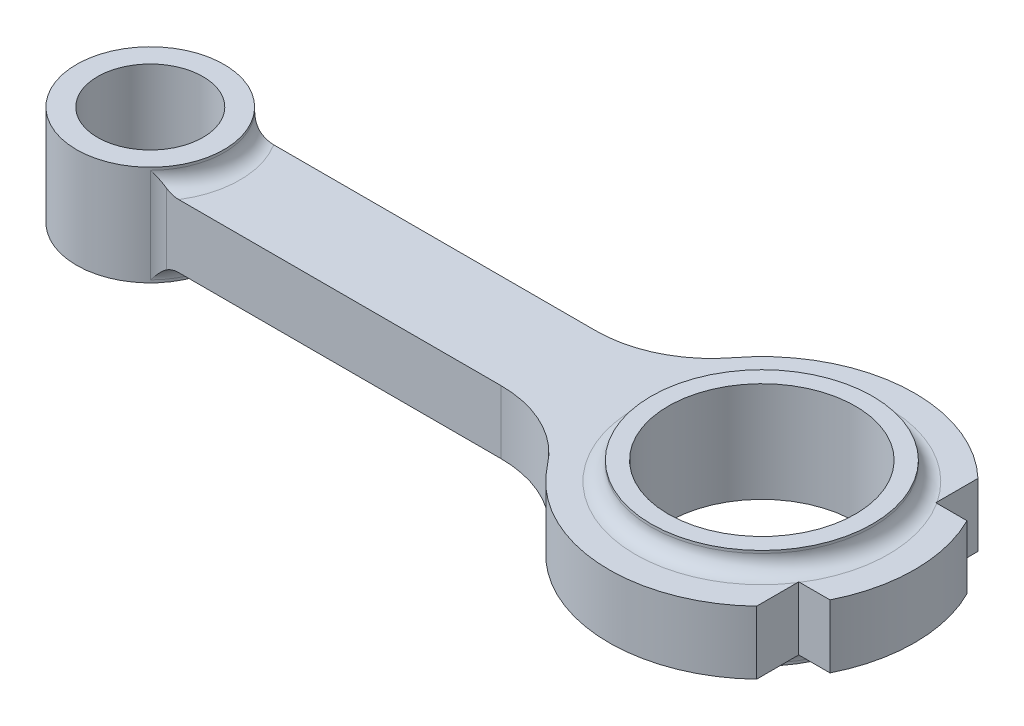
ISO-10303-21;
HEADER;
FILE_DESCRIPTION(('STEP AP214'),'2;1');
FILE_NAME('part.step','',(''),(''),'','','');
FILE_SCHEMA(('AUTOMOTIVE_DESIGN { 1 0 10303 214 1 1 1 1 }'));
ENDSEC;
DATA;
#1=APPLICATION_CONTEXT('core data for automotive mechanical design processes');
#2=APPLICATION_PROTOCOL_DEFINITION('international standard','automotive_design',2000,#1);
#3=PRODUCT_CONTEXT('',#1,'mechanical');
#4=PRODUCT('Part','Part','',(#3));
#5=PRODUCT_RELATED_PRODUCT_CATEGORY('part','',(#4));
#6=PRODUCT_DEFINITION_FORMATION('','',#4);
#7=PRODUCT_DEFINITION_CONTEXT('part definition',#1,'design');
#8=PRODUCT_DEFINITION('design','',#6,#7);
#9=PRODUCT_DEFINITION_SHAPE('','',#8);
#10=(LENGTH_UNIT() NAMED_UNIT(*) SI_UNIT(.MILLI.,.METRE.));
#11=(NAMED_UNIT(*) PLANE_ANGLE_UNIT() SI_UNIT($,.RADIAN.));
#12=(NAMED_UNIT(*) SI_UNIT($,.STERADIAN.) SOLID_ANGLE_UNIT());
#13=UNCERTAINTY_MEASURE_WITH_UNIT(LENGTH_MEASURE(1.E-05),#10,'distance_accuracy_value','');
#14=(GEOMETRIC_REPRESENTATION_CONTEXT(3) GLOBAL_UNCERTAINTY_ASSIGNED_CONTEXT((#13)) GLOBAL_UNIT_ASSIGNED_CONTEXT((#10,
#11,#12)) REPRESENTATION_CONTEXT('',''));
#15=CARTESIAN_POINT('',(0.,0.,0.));
#16=DIRECTION('',(0.,0.,1.));
#17=DIRECTION('',(1.,0.,0.));
#18=AXIS2_PLACEMENT_3D('',#15,#16,#17);
#19=CARTESIAN_POINT('',(0.,-6.,0.));
#20=DIRECTION('',(0.,1.,0.));
#21=DIRECTION('',(0.,0.,1.));
#22=AXIS2_PLACEMENT_3D('',#19,#20,#21);
#23=PLANE('',#22);
#24=DIRECTION('',(1.,0.,0.));
#25=VECTOR('',#24,1.);
#26=CARTESIAN_POINT('',(10.7238052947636,-6.,9.));
#27=LINE('',#26,#25);
#28=CARTESIAN_POINT('',(14.422205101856,-6.,9.));
#29=VERTEX_POINT('',#28);
#30=CARTESIAN_POINT('',(75.5030865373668,-6.,9.));
#31=VERTEX_POINT('',#30);
#32=EDGE_CURVE('E201',#29,#31,#27,.T.);
#33=ORIENTED_EDGE('',*,*,#32,.F.);
#34=CARTESIAN_POINT('',(0.,-6.,0.));
#35=DIRECTION('',(0.,1.,0.));
#36=DIRECTION('',(0.,0.,1.));
#37=AXIS2_PLACEMENT_3D('',#34,#35,#36);
#38=CIRCLE('',#37,17.);
#39=CARTESIAN_POINT('',(14.422205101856,-6.,-9.));
#40=VERTEX_POINT('',#39);
#41=EDGE_CURVE('E309',#29,#40,#38,.T.);
#42=ORIENTED_EDGE('',*,*,#41,.T.);
#43=DIRECTION('',(-1.,0.,0.));
#44=VECTOR('',#43,1.);
#45=CARTESIAN_POINT('',(10.7238052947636,-6.,-9.));
#46=LINE('',#45,#44);
#47=CARTESIAN_POINT('',(75.5030865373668,-6.,-9.));
#48=VERTEX_POINT('',#47);
#49=EDGE_CURVE('E195',#48,#40,#46,.T.);
#50=ORIENTED_EDGE('',*,*,#49,.F.);
#51=CARTESIAN_POINT('',(75.5030865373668,-6.,-31.));
#52=DIRECTION('',(0.,-1.,0.));
#53=DIRECTION('',(0.,0.,1.));
#54=AXIS2_PLACEMENT_3D('',#51,#52,#53);
#55=CIRCLE('',#54,22.);
#56=CARTESIAN_POINT('',(92.9723433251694,-6.,-17.6274509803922));
#57=VERTEX_POINT('',#56);
#58=EDGE_CURVE('E254',#57,#48,#55,.T.);
#59=ORIENTED_EDGE('',*,*,#58,.F.);
#60=CARTESIAN_POINT('',(116.,-6.,0.));
#61=DIRECTION('',(0.,1.,0.));
#62=DIRECTION('',(0.,0.,1.));
#63=AXIS2_PLACEMENT_3D('',#60,#61,#62);
#64=CIRCLE('',#63,29.);
#65=CARTESIAN_POINT('',(136.,-6.,-21.));
#66=VERTEX_POINT('',#65);
#67=EDGE_CURVE('E252',#66,#57,#64,.T.);
#68=ORIENTED_EDGE('',*,*,#67,.F.);
#69=DIRECTION('',(0.,0.,-1.));
#70=VECTOR('',#69,1.);
#71=CARTESIAN_POINT('',(136.,-6.,-21.));
#72=LINE('',#71,#70);
#73=CARTESIAN_POINT('',(136.,-6.,-13.2664991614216));
#74=VERTEX_POINT('',#73);
#75=EDGE_CURVE('E250',#74,#66,#72,.T.);
#76=ORIENTED_EDGE('',*,*,#75,.F.);
#77=CARTESIAN_POINT('',(116.,-6.,0.));
#78=DIRECTION('',(0.,1.,0.));
#79=DIRECTION('',(0.,0.,1.));
#80=AXIS2_PLACEMENT_3D('',#77,#78,#79);
#81=CIRCLE('',#80,24.);
#82=CARTESIAN_POINT('',(136.,-6.,13.2664991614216));
#83=VERTEX_POINT('',#82);
#84=EDGE_CURVE('E306',#74,#83,#81,.T.);
#85=ORIENTED_EDGE('',*,*,#84,.T.);
#86=DIRECTION('',(0.,0.,-1.));
#87=VECTOR('',#86,1.);
#88=CARTESIAN_POINT('',(136.,-6.,21.));
#89=LINE('',#88,#87);
#90=CARTESIAN_POINT('',(136.,-6.,21.));
#91=VERTEX_POINT('',#90);
#92=EDGE_CURVE('E240',#91,#83,#89,.T.);
#93=ORIENTED_EDGE('',*,*,#92,.F.);
#94=CARTESIAN_POINT('',(116.,-6.,0.));
#95=DIRECTION('',(0.,1.,0.));
#96=DIRECTION('',(0.,0.,1.));
#97=AXIS2_PLACEMENT_3D('',#94,#95,#96);
#98=CIRCLE('',#97,29.);
#99=CARTESIAN_POINT('',(92.9723433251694,-6.,17.6274509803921));
#100=VERTEX_POINT('',#99);
#101=EDGE_CURVE('E238',#100,#91,#98,.T.);
#102=ORIENTED_EDGE('',*,*,#101,.F.);
#103=CARTESIAN_POINT('',(75.5030865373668,-6.,31.));
#104=DIRECTION('',(0.,-1.,0.));
#105=DIRECTION('',(0.,0.,-1.));
#106=AXIS2_PLACEMENT_3D('',#103,#104,#105);
#107=CIRCLE('',#106,22.);
#108=EDGE_CURVE('E235',#31,#100,#107,.T.);
#109=ORIENTED_EDGE('',*,*,#108,.F.);
#110=EDGE_LOOP('',(#33,#42,#50,#59,#68,#76,#85,#93,#102,#109));
#111=FACE_BOUND('',#110,.T.);
#112=ADVANCED_FACE('F39',(#111),#23,.F.);
#113=CARTESIAN_POINT('',(0.,6.,0.));
#114=DIRECTION('',(0.,1.,0.));
#115=DIRECTION('',(0.,0.,1.));
#116=AXIS2_PLACEMENT_3D('',#113,#114,#115);
#117=PLANE('',#116);
#118=DIRECTION('',(-1.,0.,0.));
#119=VECTOR('',#118,1.);
#120=CARTESIAN_POINT('',(10.7238052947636,6.,-9.));
#121=LINE('',#120,#119);
#122=CARTESIAN_POINT('',(75.5030865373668,6.,-9.));
#123=VERTEX_POINT('',#122);
#124=CARTESIAN_POINT('',(14.422205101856,6.,-9.));
#125=VERTEX_POINT('',#124);
#126=EDGE_CURVE('E231',#123,#125,#121,.T.);
#127=ORIENTED_EDGE('',*,*,#126,.T.);
#128=CARTESIAN_POINT('',(0.,6.,0.));
#129=DIRECTION('',(0.,1.,0.));
#130=DIRECTION('',(0.,0.,1.));
#131=AXIS2_PLACEMENT_3D('',#128,#129,#130);
#132=CIRCLE('',#131,17.);
#133=CARTESIAN_POINT('',(14.422205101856,6.,9.));
#134=VERTEX_POINT('',#133);
#135=EDGE_CURVE('E191',#125,#134,#132,.F.);
#136=ORIENTED_EDGE('',*,*,#135,.T.);
#137=DIRECTION('',(1.,0.,0.));
#138=VECTOR('',#137,1.);
#139=CARTESIAN_POINT('',(10.7238052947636,6.,9.));
#140=LINE('',#139,#138);
#141=CARTESIAN_POINT('',(75.5030865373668,6.,9.));
#142=VERTEX_POINT('',#141);
#143=EDGE_CURVE('E183',#134,#142,#140,.T.);
#144=ORIENTED_EDGE('',*,*,#143,.T.);
#145=CARTESIAN_POINT('',(75.5030865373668,6.,31.));
#146=DIRECTION('',(0.,-1.,0.));
#147=DIRECTION('',(0.,0.,-1.));
#148=AXIS2_PLACEMENT_3D('',#145,#146,#147);
#149=CIRCLE('',#148,22.);
#150=CARTESIAN_POINT('',(92.9723433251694,6.,17.6274509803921));
#151=VERTEX_POINT('',#150);
#152=EDGE_CURVE('E188',#142,#151,#149,.T.);
#153=ORIENTED_EDGE('',*,*,#152,.T.);
#154=CARTESIAN_POINT('',(116.,6.,0.));
#155=DIRECTION('',(0.,1.,0.));
#156=DIRECTION('',(0.,0.,1.));
#157=AXIS2_PLACEMENT_3D('',#154,#155,#156);
#158=CIRCLE('',#157,29.);
#159=CARTESIAN_POINT('',(136.,6.,21.));
#160=VERTEX_POINT('',#159);
#161=EDGE_CURVE('E210',#151,#160,#158,.T.);
#162=ORIENTED_EDGE('',*,*,#161,.T.);
#163=DIRECTION('',(0.,0.,-1.));
#164=VECTOR('',#163,1.);
#165=CARTESIAN_POINT('',(136.,6.,21.));
#166=LINE('',#165,#164);
#167=CARTESIAN_POINT('',(136.,6.,13.2664991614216));
#168=VERTEX_POINT('',#167);
#169=EDGE_CURVE('E212',#160,#168,#166,.T.);
#170=ORIENTED_EDGE('',*,*,#169,.T.);
#171=CARTESIAN_POINT('',(116.,6.,0.));
#172=DIRECTION('',(0.,1.,0.));
#173=DIRECTION('',(0.,0.,1.));
#174=AXIS2_PLACEMENT_3D('',#171,#172,#173);
#175=CIRCLE('',#174,24.);
#176=CARTESIAN_POINT('',(136.,6.,-13.2664991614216));
#177=VERTEX_POINT('',#176);
#178=EDGE_CURVE('E300',#168,#177,#175,.F.);
#179=ORIENTED_EDGE('',*,*,#178,.T.);
#180=DIRECTION('',(0.,0.,-1.));
#181=VECTOR('',#180,1.);
#182=CARTESIAN_POINT('',(136.,6.,-21.));
#183=LINE('',#182,#181);
#184=CARTESIAN_POINT('',(136.,6.,-21.));
#185=VERTEX_POINT('',#184);
#186=EDGE_CURVE('E225',#177,#185,#183,.T.);
#187=ORIENTED_EDGE('',*,*,#186,.T.);
#188=CARTESIAN_POINT('',(116.,6.,0.));
#189=DIRECTION('',(0.,1.,0.));
#190=DIRECTION('',(0.,0.,1.));
#191=AXIS2_PLACEMENT_3D('',#188,#189,#190);
#192=CIRCLE('',#191,29.);
#193=CARTESIAN_POINT('',(92.9723433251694,6.,-17.6274509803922));
#194=VERTEX_POINT('',#193);
#195=EDGE_CURVE('E227',#185,#194,#192,.T.);
#196=ORIENTED_EDGE('',*,*,#195,.T.);
#197=CARTESIAN_POINT('',(75.5030865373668,6.,-31.));
#198=DIRECTION('',(0.,-1.,0.));
#199=DIRECTION('',(0.,0.,1.));
#200=AXIS2_PLACEMENT_3D('',#197,#198,#199);
#201=CIRCLE('',#200,22.);
#202=EDGE_CURVE('E229',#194,#123,#201,.T.);
#203=ORIENTED_EDGE('',*,*,#202,.T.);
#204=EDGE_LOOP('',(#127,#136,#144,#153,#162,#170,#179,#187,#196,#203));
#205=FACE_BOUND('',#204,.T.);
#206=ADVANCED_FACE('F186',(#205),#117,.T.);
#207=CARTESIAN_POINT('',(0.,6.,0.));
#208=DIRECTION('',(0.,-1.,0.));
#209=DIRECTION('',(0.,0.,-1.));
#210=AXIS2_PLACEMENT_3D('',#207,#208,#209);
#211=CYLINDRICAL_SURFACE('',#210,14.);
#212=DIRECTION('',(0.,-1.,0.));
#213=VECTOR('',#212,1.);
#214=CARTESIAN_POINT('',(9.91660730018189,6.,9.88235294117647));
#215=LINE('',#214,#213);
#216=CARTESIAN_POINT('',(9.91660730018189,-9.,9.88235294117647));
#217=VERTEX_POINT('',#216);
#218=CARTESIAN_POINT('',(9.91660730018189,9.,9.88235294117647));
#219=VERTEX_POINT('',#218);
#220=EDGE_CURVE('E287',#217,#219,#215,.F.);
#221=ORIENTED_EDGE('',*,*,#220,.T.);
#222=CARTESIAN_POINT('',(0.,9.,0.));
#223=DIRECTION('',(0.,1.,0.));
#224=DIRECTION('',(0.,0.,1.));
#225=AXIS2_PLACEMENT_3D('',#222,#223,#224);
#226=CIRCLE('',#225,14.);
#227=CARTESIAN_POINT('',(9.91660730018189,9.,-9.88235294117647));
#228=VERTEX_POINT('',#227);
#229=EDGE_CURVE('E292',#219,#228,#226,.T.);
#230=ORIENTED_EDGE('',*,*,#229,.T.);
#231=DIRECTION('',(0.,-1.,0.));
#232=VECTOR('',#231,1.);
#233=CARTESIAN_POINT('',(9.91660730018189,6.,-9.88235294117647));
#234=LINE('',#233,#232);
#235=CARTESIAN_POINT('',(9.91660730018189,-9.,-9.88235294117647));
#236=VERTEX_POINT('',#235);
#237=EDGE_CURVE('E289',#228,#236,#234,.T.);
#238=ORIENTED_EDGE('',*,*,#237,.T.);
#239=CARTESIAN_POINT('',(0.,-9.,0.));
#240=DIRECTION('',(0.,1.,0.));
#241=DIRECTION('',(0.,0.,1.));
#242=AXIS2_PLACEMENT_3D('',#239,#240,#241);
#243=CIRCLE('',#242,14.);
#244=EDGE_CURVE('E204',#236,#217,#243,.F.);
#245=ORIENTED_EDGE('',*,*,#244,.T.);
#246=EDGE_LOOP('',(#221,#230,#238,#245));
#247=FACE_BOUND('',#246,.T.);
#248=CARTESIAN_POINT('',(0.,-9.5,0.));
#249=DIRECTION('',(0.,1.,0.));
#250=DIRECTION('',(0.,0.,1.));
#251=AXIS2_PLACEMENT_3D('',#248,#249,#250);
#252=CIRCLE('',#251,14.);
#253=CARTESIAN_POINT('',(0.,-9.5,14.));
#254=VERTEX_POINT('',#253);
#255=EDGE_CURVE('E538',#254,#254,#252,.T.);
#256=ORIENTED_EDGE('',*,*,#255,.T.);
#257=EDGE_LOOP('',(#256));
#258=FACE_BOUND('',#257,.T.);
#259=CARTESIAN_POINT('',(0.,9.5,0.));
#260=DIRECTION('',(0.,1.,0.));
#261=DIRECTION('',(0.,0.,1.));
#262=AXIS2_PLACEMENT_3D('',#259,#260,#261);
#263=CIRCLE('',#262,14.);
#264=CARTESIAN_POINT('',(0.,9.5,14.));
#265=VERTEX_POINT('',#264);
#266=EDGE_CURVE('E236',#265,#265,#263,.T.);
#267=ORIENTED_EDGE('',*,*,#266,.F.);
#268=EDGE_LOOP('',(#267));
#269=FACE_BOUND('',#268,.T.);
#270=ADVANCED_FACE('F370',(#247,#258,#269),#211,.T.);
#271=CARTESIAN_POINT('',(10.7238052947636,6.,9.));
#272=DIRECTION('',(0.,0.,-1.));
#273=DIRECTION('',(-1.,0.,0.));
#274=AXIS2_PLACEMENT_3D('',#271,#272,#273);
#275=PLANE('',#274);
#276=ORIENTED_EDGE('',*,*,#143,.F.);
#277=CARTESIAN_POINT('',(14.422205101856,6.,9.));
#278=CARTESIAN_POINT('',(14.2926652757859,6.00001803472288,9.));
#279=CARTESIAN_POINT('',(14.1632279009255,6.00604067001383,9.));
#280=CARTESIAN_POINT('',(13.9054130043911,6.02988516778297,9.));
#281=CARTESIAN_POINT('',(13.7770357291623,6.04770969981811,9.));
#282=CARTESIAN_POINT('',(13.4019529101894,6.11725277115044,9.));
#283=CARTESIAN_POINT('',(13.1579920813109,6.18508325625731,9.));
#284=CARTESIAN_POINT('',(12.7681333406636,6.33205951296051,9.));
#285=CARTESIAN_POINT('',(12.6175516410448,6.39913693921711,9.));
#286=CARTESIAN_POINT('',(12.3973138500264,6.51373319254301,9.));
#287=CARTESIAN_POINT('',(12.3242209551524,6.55468746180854,9.));
#288=CARTESIAN_POINT('',(12.1807619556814,6.64119544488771,9.));
#289=CARTESIAN_POINT('',(12.1103972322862,6.68675144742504,9.));
#290=CARTESIAN_POINT('',(12.0415945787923,6.73459123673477,9.));
#291=B_SPLINE_CURVE_WITH_KNOTS('',3,(#277,#278,#279,#280,#281,#282,#283,#284,#285,#286,#287,
#288,#289,#290),.UNSPECIFIED.,.F.,.F.,(4,2,2,2,2,2,4),(0.,0.388285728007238,0.776659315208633,
1.53179836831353,2.02523360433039,2.27642690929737,2.52774576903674),.UNSPECIFIED.);
#292=CARTESIAN_POINT('',(12.0415945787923,6.73459123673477,9.));
#293=VERTEX_POINT('',#292);
#294=EDGE_CURVE('E317',#134,#293,#291,.T.);
#295=ORIENTED_EDGE('',*,*,#294,.T.);
#296=DIRECTION('',(0.,1.,0.));
#297=VECTOR('',#296,1.);
#298=CARTESIAN_POINT('',(12.0415945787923,-6.,9.));
#299=LINE('',#298,#297);
#300=CARTESIAN_POINT('',(12.0415945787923,-6.73459123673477,9.));
#301=VERTEX_POINT('',#300);
#302=EDGE_CURVE('E296',#293,#301,#299,.F.);
#303=ORIENTED_EDGE('',*,*,#302,.T.);
#304=CARTESIAN_POINT('',(12.0415945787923,-6.73459123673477,9.));
#305=CARTESIAN_POINT('',(12.1482045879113,-6.66048426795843,9.));
#306=CARTESIAN_POINT('',(12.2585398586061,-6.59184174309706,9.));
#307=CARTESIAN_POINT('',(12.4853214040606,-6.46561457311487,9.));
#308=CARTESIAN_POINT('',(12.6017654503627,-6.40802593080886,9.));
#309=CARTESIAN_POINT('',(12.8363697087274,-6.30535343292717,9.));
#310=CARTESIAN_POINT('',(12.9544037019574,-6.25997988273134,9.));
#311=CARTESIAN_POINT('',(13.1940085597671,-6.17993199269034,9.));
#312=CARTESIAN_POINT('',(13.3155787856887,-6.14525573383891,9.));
#313=CARTESIAN_POINT('',(13.5980055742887,-6.0780318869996,9.));
#314=CARTESIAN_POINT('',(13.7597620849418,-6.0492059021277,9.));
#315=CARTESIAN_POINT('',(14.0883841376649,-6.01002616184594,9.));
#316=CARTESIAN_POINT('',(14.2552894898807,-6.00000655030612,9.));
#317=CARTESIAN_POINT('',(14.422205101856,-6.,9.));
#318=B_SPLINE_CURVE_WITH_KNOTS('',3,(#304,#305,#306,#307,#308,#309,#310,#311,#312,#313,#314,
#315,#316,#317),.UNSPECIFIED.,.F.,.F.,(4,2,2,2,2,2,4),(0.,0.389255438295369,0.778369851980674,
1.15722376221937,1.53600966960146,2.02780445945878,2.52825744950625),.UNSPECIFIED.);
#319=EDGE_CURVE('E515',#301,#29,#318,.T.);
#320=ORIENTED_EDGE('',*,*,#319,.T.);
#321=ORIENTED_EDGE('',*,*,#32,.T.);
#322=DIRECTION('',(0.,-1.,0.));
#323=VECTOR('',#322,1.);
#324=CARTESIAN_POINT('',(75.5030865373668,6.,9.));
#325=LINE('',#324,#323);
#326=EDGE_CURVE('E198',#142,#31,#325,.T.);
#327=ORIENTED_EDGE('',*,*,#326,.F.);
#328=EDGE_LOOP('',(#276,#295,#303,#320,#321,#327));
#329=FACE_BOUND('',#328,.T.);
#330=ADVANCED_FACE('F199',(#329),#275,.F.);
#331=CARTESIAN_POINT('',(75.5030865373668,6.,31.));
#332=DIRECTION('',(0.,-1.,0.));
#333=DIRECTION('',(0.,0.,-1.));
#334=AXIS2_PLACEMENT_3D('',#331,#332,#333);
#335=CYLINDRICAL_SURFACE('',#334,22.);
#336=ORIENTED_EDGE('',*,*,#108,.T.);
#337=DIRECTION('',(0.,-1.,0.));
#338=VECTOR('',#337,1.);
#339=CARTESIAN_POINT('',(92.9723433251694,6.,17.6274509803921));
#340=LINE('',#339,#338);
#341=EDGE_CURVE('E205',#151,#100,#340,.T.);
#342=ORIENTED_EDGE('',*,*,#341,.F.);
#343=ORIENTED_EDGE('',*,*,#152,.F.);
#344=ORIENTED_EDGE('',*,*,#326,.T.);
#345=EDGE_LOOP('',(#336,#342,#343,#344));
#346=FACE_BOUND('',#345,.T.);
#347=ADVANCED_FACE('F207',(#346),#335,.F.);
#348=CARTESIAN_POINT('',(116.,6.,0.));
#349=DIRECTION('',(0.,-1.,0.));
#350=DIRECTION('',(0.,0.,-1.));
#351=AXIS2_PLACEMENT_3D('',#348,#349,#350);
#352=CYLINDRICAL_SURFACE('',#351,29.);
#353=ORIENTED_EDGE('',*,*,#101,.T.);
#354=DIRECTION('',(0.,-1.,0.));
#355=VECTOR('',#354,1.);
#356=CARTESIAN_POINT('',(136.,6.,21.));
#357=LINE('',#356,#355);
#358=EDGE_CURVE('E274',#160,#91,#357,.T.);
#359=ORIENTED_EDGE('',*,*,#358,.F.);
#360=ORIENTED_EDGE('',*,*,#161,.F.);
#361=ORIENTED_EDGE('',*,*,#341,.T.);
#362=EDGE_LOOP('',(#353,#359,#360,#361));
#363=FACE_BOUND('',#362,.T.);
#364=ADVANCED_FACE('F462',(#363),#352,.T.);
#365=CARTESIAN_POINT('',(136.,6.,21.));
#366=DIRECTION('',(-1.,0.,0.));
#367=DIRECTION('',(0.,0.,1.));
#368=AXIS2_PLACEMENT_3D('',#365,#366,#367);
#369=PLANE('',#368);
#370=ORIENTED_EDGE('',*,*,#92,.T.);
#371=CARTESIAN_POINT('',(136.,-6.,13.2664991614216));
#372=CARTESIAN_POINT('',(136.,-6.0000040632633,13.2220747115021));
#373=CARTESIAN_POINT('',(136.,-6.00030346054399,13.1776542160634));
#374=CARTESIAN_POINT('',(136.,-6.00149292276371,13.0888211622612));
#375=CARTESIAN_POINT('',(136.,-6.00238298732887,13.0444086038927));
#376=CARTESIAN_POINT('',(136.,-6.00356838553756,13.));
#377=B_SPLINE_CURVE_WITH_KNOTS('',3,(#371,#372,#373,#374,#375,#376),.UNSPECIFIED.,.F.,.F.,(4,2,
4),(0.,0.13326451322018,0.266528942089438),.UNSPECIFIED.);
#378=CARTESIAN_POINT('',(136.,-6.00356838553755,13.));
#379=VERTEX_POINT('',#378);
#380=EDGE_CURVE('E419',#83,#379,#377,.T.);
#381=ORIENTED_EDGE('',*,*,#380,.T.);
#382=DIRECTION('',(0.,-1.,0.));
#383=VECTOR('',#382,1.);
#384=CARTESIAN_POINT('',(136.,6.,13.));
#385=LINE('',#384,#383);
#386=CARTESIAN_POINT('',(136.,6.00356838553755,13.));
#387=VERTEX_POINT('',#386);
#388=EDGE_CURVE('E62',#387,#379,#385,.T.);
#389=ORIENTED_EDGE('',*,*,#388,.F.);
#390=CARTESIAN_POINT('',(136.,6.00356838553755,13.));
#391=CARTESIAN_POINT('',(136.,6.00238298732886,13.0444086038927));
#392=CARTESIAN_POINT('',(136.,6.00149292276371,13.0888211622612));
#393=CARTESIAN_POINT('',(136.,6.00030346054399,13.1776542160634));
#394=CARTESIAN_POINT('',(136.,6.0000040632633,13.2220747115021));
#395=CARTESIAN_POINT('',(136.,6.,13.2664991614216));
#396=B_SPLINE_CURVE_WITH_KNOTS('',3,(#390,#391,#392,#393,#394,#395),.UNSPECIFIED.,.F.,.F.,(4,2,
4),(0.,0.133264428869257,0.266528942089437),.UNSPECIFIED.);
#397=EDGE_CURVE('E11',#387,#168,#396,.T.);
#398=ORIENTED_EDGE('',*,*,#397,.T.);
#399=ORIENTED_EDGE('',*,*,#169,.F.);
#400=ORIENTED_EDGE('',*,*,#358,.T.);
#401=EDGE_LOOP('',(#370,#381,#389,#398,#399,#400));
#402=FACE_BOUND('',#401,.T.);
#403=ADVANCED_FACE('F457',(#402),#369,.F.);
#404=CARTESIAN_POINT('',(136.,6.,13.));
#405=DIRECTION('',(0.,0.,-1.));
#406=DIRECTION('',(-1.,0.,0.));
#407=AXIS2_PLACEMENT_3D('',#404,#405,#406);
#408=PLANE('',#407);
#409=ORIENTED_EDGE('',*,*,#388,.T.);
#410=CARTESIAN_POINT('',(136.,-6.00356838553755,13.));
#411=CARTESIAN_POINT('',(136.029027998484,-6.00237966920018,13.));
#412=CARTESIAN_POINT('',(136.058062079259,-6.00148794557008,13.));
#413=CARTESIAN_POINT('',(136.1161424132,-6.00029848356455,13.));
#414=CARTESIAN_POINT('',(136.145188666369,-6.0000007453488,13.));
#415=CARTESIAN_POINT('',(136.174241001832,-6.,13.));
#416=B_SPLINE_CURVE_WITH_KNOTS('',3,(#410,#411,#412,#413,#414,#415),.UNSPECIFIED.,.F.,.F.,(4,2,
4),(0.,0.0871433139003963,0.174286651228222),.UNSPECIFIED.);
#417=CARTESIAN_POINT('',(136.174241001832,-6.,13.));
#418=VERTEX_POINT('',#417);
#419=EDGE_CURVE('E411',#379,#418,#416,.T.);
#420=ORIENTED_EDGE('',*,*,#419,.T.);
#421=DIRECTION('',(1.,0.,0.));
#422=VECTOR('',#421,1.);
#423=CARTESIAN_POINT('',(136.,-6.,13.));
#424=LINE('',#423,#422);
#425=CARTESIAN_POINT('',(141.922962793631,-6.,13.));
#426=VERTEX_POINT('',#425);
#427=EDGE_CURVE('E243',#418,#426,#424,.T.);
#428=ORIENTED_EDGE('',*,*,#427,.T.);
#429=DIRECTION('',(0.,-1.,0.));
#430=VECTOR('',#429,1.);
#431=CARTESIAN_POINT('',(141.922962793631,6.,13.));
#432=LINE('',#431,#430);
#433=CARTESIAN_POINT('',(141.922962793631,6.,13.));
#434=VERTEX_POINT('',#433);
#435=EDGE_CURVE('E270',#434,#426,#432,.T.);
#436=ORIENTED_EDGE('',*,*,#435,.F.);
#437=DIRECTION('',(1.,0.,0.));
#438=VECTOR('',#437,1.);
#439=CARTESIAN_POINT('',(136.,6.,13.));
#440=LINE('',#439,#438);
#441=CARTESIAN_POINT('',(136.174241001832,6.,13.));
#442=VERTEX_POINT('',#441);
#443=EDGE_CURVE('E218',#442,#434,#440,.T.);
#444=ORIENTED_EDGE('',*,*,#443,.F.);
#445=CARTESIAN_POINT('',(136.174241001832,6.,13.));
#446=CARTESIAN_POINT('',(136.145188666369,6.00000074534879,13.));
#447=CARTESIAN_POINT('',(136.1161424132,6.00029848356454,13.));
#448=CARTESIAN_POINT('',(136.058062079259,6.00148794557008,13.));
#449=CARTESIAN_POINT('',(136.029027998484,6.00237966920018,13.));
#450=CARTESIAN_POINT('',(136.,6.00356838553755,13.));
#451=B_SPLINE_CURVE_WITH_KNOTS('',3,(#445,#446,#447,#448,#449,#450),.UNSPECIFIED.,.F.,.F.,(4,2,
4),(0.,0.087143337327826,0.174286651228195),.UNSPECIFIED.);
#452=EDGE_CURVE('E55',#442,#387,#451,.T.);
#453=ORIENTED_EDGE('',*,*,#452,.T.);
#454=EDGE_LOOP('',(#409,#420,#428,#436,#444,#453));
#455=FACE_BOUND('',#454,.T.);
#456=ADVANCED_FACE('F461',(#455),#408,.F.);
#457=CARTESIAN_POINT('',(116.,6.,0.));
#458=DIRECTION('',(0.,-1.,0.));
#459=DIRECTION('',(0.,0.,-1.));
#460=AXIS2_PLACEMENT_3D('',#457,#458,#459);
#461=CYLINDRICAL_SURFACE('',#460,29.);
#462=CARTESIAN_POINT('',(116.,-6.,0.));
#463=DIRECTION('',(0.,1.,0.));
#464=DIRECTION('',(0.,0.,1.));
#465=AXIS2_PLACEMENT_3D('',#462,#463,#464);
#466=CIRCLE('',#465,29.);
#467=CARTESIAN_POINT('',(141.922962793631,-6.,-13.));
#468=VERTEX_POINT('',#467);
#469=EDGE_CURVE('E245',#426,#468,#466,.T.);
#470=ORIENTED_EDGE('',*,*,#469,.T.);
#471=DIRECTION('',(0.,-1.,0.));
#472=VECTOR('',#471,1.);
#473=CARTESIAN_POINT('',(141.922962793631,6.,-13.));
#474=LINE('',#473,#472);
#475=CARTESIAN_POINT('',(141.922962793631,6.,-13.));
#476=VERTEX_POINT('',#475);
#477=EDGE_CURVE('E267',#476,#468,#474,.T.);
#478=ORIENTED_EDGE('',*,*,#477,.F.);
#479=CARTESIAN_POINT('',(116.,6.,0.));
#480=DIRECTION('',(0.,1.,0.));
#481=DIRECTION('',(0.,0.,1.));
#482=AXIS2_PLACEMENT_3D('',#479,#480,#481);
#483=CIRCLE('',#482,29.);
#484=EDGE_CURVE('E220',#434,#476,#483,.T.);
#485=ORIENTED_EDGE('',*,*,#484,.F.);
#486=ORIENTED_EDGE('',*,*,#435,.T.);
#487=EDGE_LOOP('',(#470,#478,#485,#486));
#488=FACE_BOUND('',#487,.T.);
#489=ADVANCED_FACE('F693',(#488),#461,.T.);
#490=CARTESIAN_POINT('',(136.,6.,-13.));
#491=DIRECTION('',(0.,0.,1.));
#492=DIRECTION('',(1.,0.,0.));
#493=AXIS2_PLACEMENT_3D('',#490,#491,#492);
#494=PLANE('',#493);
#495=DIRECTION('',(-1.,0.,0.));
#496=VECTOR('',#495,1.);
#497=CARTESIAN_POINT('',(136.,-6.,-13.));
#498=LINE('',#497,#496);
#499=CARTESIAN_POINT('',(136.174241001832,-6.,-13.));
#500=VERTEX_POINT('',#499);
#501=EDGE_CURVE('E247',#468,#500,#498,.T.);
#502=ORIENTED_EDGE('',*,*,#501,.T.);
#503=CARTESIAN_POINT('',(136.174241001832,-6.,-13.));
#504=CARTESIAN_POINT('',(136.145188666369,-6.00000074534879,-13.));
#505=CARTESIAN_POINT('',(136.1161424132,-6.00029848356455,-13.));
#506=CARTESIAN_POINT('',(136.058062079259,-6.00148794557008,-13.));
#507=CARTESIAN_POINT('',(136.029027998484,-6.00237966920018,-13.));
#508=CARTESIAN_POINT('',(136.,-6.00356838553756,-13.));
#509=B_SPLINE_CURVE_WITH_KNOTS('',3,(#503,#504,#505,#506,#507,#508),.UNSPECIFIED.,.F.,.F.,(4,2,
4),(0.,0.087143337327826,0.174286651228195),.UNSPECIFIED.);
#510=CARTESIAN_POINT('',(136.,-6.00356838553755,-13.));
#511=VERTEX_POINT('',#510);
#512=EDGE_CURVE('E413',#500,#511,#509,.T.);
#513=ORIENTED_EDGE('',*,*,#512,.T.);
#514=DIRECTION('',(0.,-1.,0.));
#515=VECTOR('',#514,1.);
#516=CARTESIAN_POINT('',(136.,6.,-13.));
#517=LINE('',#516,#515);
#518=CARTESIAN_POINT('',(136.,6.00356838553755,-13.));
#519=VERTEX_POINT('',#518);
#520=EDGE_CURVE('E70',#519,#511,#517,.T.);
#521=ORIENTED_EDGE('',*,*,#520,.F.);
#522=CARTESIAN_POINT('',(136.,6.00356838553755,-13.));
#523=CARTESIAN_POINT('',(136.029027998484,6.00237966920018,-13.));
#524=CARTESIAN_POINT('',(136.058062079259,6.00148794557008,-13.));
#525=CARTESIAN_POINT('',(136.1161424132,6.00029848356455,-13.));
#526=CARTESIAN_POINT('',(136.145188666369,6.00000074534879,-13.));
#527=CARTESIAN_POINT('',(136.174241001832,6.,-13.));
#528=B_SPLINE_CURVE_WITH_KNOTS('',3,(#522,#523,#524,#525,#526,#527),.UNSPECIFIED.,.F.,.F.,(4,2,
4),(0.,0.0871433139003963,0.174286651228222),.UNSPECIFIED.);
#529=CARTESIAN_POINT('',(136.174241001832,6.,-13.));
#530=VERTEX_POINT('',#529);
#531=EDGE_CURVE('E475',#519,#530,#528,.T.);
#532=ORIENTED_EDGE('',*,*,#531,.T.);
#533=DIRECTION('',(-1.,0.,0.));
#534=VECTOR('',#533,1.);
#535=CARTESIAN_POINT('',(136.,6.,-13.));
#536=LINE('',#535,#534);
#537=EDGE_CURVE('E222',#476,#530,#536,.T.);
#538=ORIENTED_EDGE('',*,*,#537,.F.);
#539=ORIENTED_EDGE('',*,*,#477,.T.);
#540=EDGE_LOOP('',(#502,#513,#521,#532,#538,#539));
#541=FACE_BOUND('',#540,.T.);
#542=ADVANCED_FACE('F438',(#541),#494,.F.);
#543=CARTESIAN_POINT('',(136.,6.,-21.));
#544=DIRECTION('',(-1.,0.,0.));
#545=DIRECTION('',(0.,0.,1.));
#546=AXIS2_PLACEMENT_3D('',#543,#544,#545);
#547=PLANE('',#546);
#548=ORIENTED_EDGE('',*,*,#520,.T.);
#549=CARTESIAN_POINT('',(136.,-6.00356838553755,-13.));
#550=CARTESIAN_POINT('',(136.,-6.00238298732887,-13.0444086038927));
#551=CARTESIAN_POINT('',(136.,-6.00149292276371,-13.0888211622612));
#552=CARTESIAN_POINT('',(136.,-6.00030346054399,-13.1776542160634));
#553=CARTESIAN_POINT('',(136.,-6.0000040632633,-13.2220747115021));
#554=CARTESIAN_POINT('',(136.,-6.,-13.2664991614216));
#555=B_SPLINE_CURVE_WITH_KNOTS('',3,(#549,#550,#551,#552,#553,#554),.UNSPECIFIED.,.F.,.F.,(4,2,
4),(0.,0.133264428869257,0.266528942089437),.UNSPECIFIED.);
#556=EDGE_CURVE('E415',#511,#74,#555,.T.);
#557=ORIENTED_EDGE('',*,*,#556,.T.);
#558=ORIENTED_EDGE('',*,*,#75,.T.);
#559=DIRECTION('',(0.,-1.,0.));
#560=VECTOR('',#559,1.);
#561=CARTESIAN_POINT('',(136.,6.,-21.));
#562=LINE('',#561,#560);
#563=EDGE_CURVE('E263',#185,#66,#562,.T.);
#564=ORIENTED_EDGE('',*,*,#563,.F.);
#565=ORIENTED_EDGE('',*,*,#186,.F.);
#566=CARTESIAN_POINT('',(136.,6.,-13.2664991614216));
#567=CARTESIAN_POINT('',(136.,6.0000040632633,-13.2220747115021));
#568=CARTESIAN_POINT('',(136.,6.00030346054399,-13.1776542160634));
#569=CARTESIAN_POINT('',(136.,6.00149292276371,-13.0888211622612));
#570=CARTESIAN_POINT('',(136.,6.00238298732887,-13.0444086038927));
#571=CARTESIAN_POINT('',(136.,6.00356838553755,-13.));
#572=B_SPLINE_CURVE_WITH_KNOTS('',3,(#566,#567,#568,#569,#570,#571),.UNSPECIFIED.,.F.,.F.,(4,2,
4),(0.,0.13326451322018,0.266528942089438),.UNSPECIFIED.);
#573=EDGE_CURVE('E417',#177,#519,#572,.T.);
#574=ORIENTED_EDGE('',*,*,#573,.T.);
#575=EDGE_LOOP('',(#548,#557,#558,#564,#565,#574));
#576=FACE_BOUND('',#575,.T.);
#577=ADVANCED_FACE('F484',(#576),#547,.F.);
#578=CARTESIAN_POINT('',(116.,6.,0.));
#579=DIRECTION('',(0.,-1.,0.));
#580=DIRECTION('',(0.,0.,-1.));
#581=AXIS2_PLACEMENT_3D('',#578,#579,#580);
#582=CYLINDRICAL_SURFACE('',#581,29.);
#583=ORIENTED_EDGE('',*,*,#67,.T.);
#584=DIRECTION('',(0.,-1.,0.));
#585=VECTOR('',#584,1.);
#586=CARTESIAN_POINT('',(92.9723433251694,6.,-17.6274509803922));
#587=LINE('',#586,#585);
#588=EDGE_CURVE('E260',#194,#57,#587,.T.);
#589=ORIENTED_EDGE('',*,*,#588,.F.);
#590=ORIENTED_EDGE('',*,*,#195,.F.);
#591=ORIENTED_EDGE('',*,*,#563,.T.);
#592=EDGE_LOOP('',(#583,#589,#590,#591));
#593=FACE_BOUND('',#592,.T.);
#594=ADVANCED_FACE('F488',(#593),#582,.T.);
#595=CARTESIAN_POINT('',(75.5030865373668,6.,-31.));
#596=DIRECTION('',(0.,-1.,0.));
#597=DIRECTION('',(0.,0.,-1.));
#598=AXIS2_PLACEMENT_3D('',#595,#596,#597);
#599=CYLINDRICAL_SURFACE('',#598,22.);
#600=ORIENTED_EDGE('',*,*,#58,.T.);
#601=DIRECTION('',(0.,-1.,0.));
#602=VECTOR('',#601,1.);
#603=CARTESIAN_POINT('',(75.5030865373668,6.,-9.));
#604=LINE('',#603,#602);
#605=EDGE_CURVE('E233',#123,#48,#604,.T.);
#606=ORIENTED_EDGE('',*,*,#605,.F.);
#607=ORIENTED_EDGE('',*,*,#202,.F.);
#608=ORIENTED_EDGE('',*,*,#588,.T.);
#609=EDGE_LOOP('',(#600,#606,#607,#608));
#610=FACE_BOUND('',#609,.T.);
#611=ADVANCED_FACE('F493',(#610),#599,.F.);
#612=CARTESIAN_POINT('',(10.7238052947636,6.,-9.));
#613=DIRECTION('',(0.,0.,1.));
#614=DIRECTION('',(1.,0.,0.));
#615=AXIS2_PLACEMENT_3D('',#612,#613,#614);
#616=PLANE('',#615);
#617=ORIENTED_EDGE('',*,*,#49,.T.);
#618=CARTESIAN_POINT('',(14.422205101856,-6.,-9.));
#619=CARTESIAN_POINT('',(14.2926652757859,-6.00001803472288,-9.));
#620=CARTESIAN_POINT('',(14.1632279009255,-6.00604067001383,-9.));
#621=CARTESIAN_POINT('',(13.9054130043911,-6.02988516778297,-9.));
#622=CARTESIAN_POINT('',(13.7770357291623,-6.04770969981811,-9.));
#623=CARTESIAN_POINT('',(13.4019529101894,-6.11725277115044,-9.));
#624=CARTESIAN_POINT('',(13.1579920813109,-6.18508325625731,-9.));
#625=CARTESIAN_POINT('',(12.7681333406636,-6.33205951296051,-9.));
#626=CARTESIAN_POINT('',(12.6175516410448,-6.39913693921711,-9.));
#627=CARTESIAN_POINT('',(12.3973138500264,-6.51373319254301,-9.));
#628=CARTESIAN_POINT('',(12.3242209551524,-6.55468746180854,-9.));
#629=CARTESIAN_POINT('',(12.1807619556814,-6.64119544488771,-9.));
#630=CARTESIAN_POINT('',(12.1103972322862,-6.68675144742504,-9.));
#631=CARTESIAN_POINT('',(12.0415945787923,-6.73459123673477,-9.));
#632=B_SPLINE_CURVE_WITH_KNOTS('',3,(#618,#619,#620,#621,#622,#623,#624,#625,#626,#627,#628,
#629,#630,#631),.UNSPECIFIED.,.F.,.F.,(4,2,2,2,2,2,4),(0.,0.388285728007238,0.776659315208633,
1.53179836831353,2.02523360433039,2.27642690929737,2.52774576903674),.UNSPECIFIED.);
#633=CARTESIAN_POINT('',(12.0415945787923,-6.73459123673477,-9.));
#634=VERTEX_POINT('',#633);
#635=EDGE_CURVE('E452',#40,#634,#632,.T.);
#636=ORIENTED_EDGE('',*,*,#635,.T.);
#637=DIRECTION('',(0.,1.,0.));
#638=VECTOR('',#637,1.);
#639=CARTESIAN_POINT('',(12.0415945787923,6.,-9.));
#640=LINE('',#639,#638);
#641=CARTESIAN_POINT('',(12.0415945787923,6.73459123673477,-9.));
#642=VERTEX_POINT('',#641);
#643=EDGE_CURVE('E294',#634,#642,#640,.T.);
#644=ORIENTED_EDGE('',*,*,#643,.T.);
#645=CARTESIAN_POINT('',(12.0415945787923,6.73459123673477,-9.));
#646=CARTESIAN_POINT('',(12.1482045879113,6.66048426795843,-9.));
#647=CARTESIAN_POINT('',(12.2585398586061,6.59184174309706,-9.));
#648=CARTESIAN_POINT('',(12.4853214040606,6.46561457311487,-9.));
#649=CARTESIAN_POINT('',(12.6017654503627,6.40802593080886,-9.));
#650=CARTESIAN_POINT('',(12.8363697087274,6.30535343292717,-9.));
#651=CARTESIAN_POINT('',(12.9544037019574,6.25997988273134,-9.));
#652=CARTESIAN_POINT('',(13.1940085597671,6.17993199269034,-9.));
#653=CARTESIAN_POINT('',(13.3155787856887,6.14525573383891,-9.));
#654=CARTESIAN_POINT('',(13.5980055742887,6.0780318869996,-9.));
#655=CARTESIAN_POINT('',(13.7597620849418,6.0492059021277,-9.));
#656=CARTESIAN_POINT('',(14.0883841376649,6.01002616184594,-9.));
#657=CARTESIAN_POINT('',(14.2552894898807,6.00000655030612,-9.));
#658=CARTESIAN_POINT('',(14.422205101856,6.,-9.));
#659=B_SPLINE_CURVE_WITH_KNOTS('',3,(#645,#646,#647,#648,#649,#650,#651,#652,#653,#654,#655,
#656,#657,#658),.UNSPECIFIED.,.F.,.F.,(4,2,2,2,2,2,4),(0.,0.389255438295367,0.778369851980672,
1.15722376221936,1.53600966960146,2.02780445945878,2.52825744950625),.UNSPECIFIED.);
#660=EDGE_CURVE('E324',#642,#125,#659,.T.);
#661=ORIENTED_EDGE('',*,*,#660,.T.);
#662=ORIENTED_EDGE('',*,*,#126,.F.);
#663=ORIENTED_EDGE('',*,*,#605,.T.);
#664=EDGE_LOOP('',(#617,#636,#644,#661,#662,#663));
#665=FACE_BOUND('',#664,.T.);
#666=ADVANCED_FACE('F399',(#665),#616,.F.);
#667=ORIENTED_EDGE('',*,*,#537,.T.);
#668=CARTESIAN_POINT('',(116.,6.,0.));
#669=DIRECTION('',(0.,1.,0.));
#670=DIRECTION('',(0.,0.,1.));
#671=AXIS2_PLACEMENT_3D('',#668,#669,#670);
#672=CIRCLE('',#671,24.);
#673=EDGE_CURVE('E298',#530,#442,#672,.F.);
#674=ORIENTED_EDGE('',*,*,#673,.T.);
#675=ORIENTED_EDGE('',*,*,#443,.T.);
#676=ORIENTED_EDGE('',*,*,#484,.T.);
#677=EDGE_LOOP('',(#667,#674,#675,#676));
#678=FACE_BOUND('',#677,.T.);
#679=ADVANCED_FACE('F379',(#678),#117,.T.);
#680=ORIENTED_EDGE('',*,*,#427,.F.);
#681=CARTESIAN_POINT('',(116.,-6.,0.));
#682=DIRECTION('',(0.,1.,0.));
#683=DIRECTION('',(0.,0.,1.));
#684=AXIS2_PLACEMENT_3D('',#681,#682,#683);
#685=CIRCLE('',#684,24.);
#686=EDGE_CURVE('E304',#418,#500,#685,.T.);
#687=ORIENTED_EDGE('',*,*,#686,.T.);
#688=ORIENTED_EDGE('',*,*,#501,.F.);
#689=ORIENTED_EDGE('',*,*,#469,.F.);
#690=EDGE_LOOP('',(#680,#687,#688,#689));
#691=FACE_BOUND('',#690,.T.);
#692=ADVANCED_FACE('F384',(#691),#23,.F.);
#693=CARTESIAN_POINT('',(116.,-9.5,0.));
#694=DIRECTION('',(0.,1.,0.));
#695=DIRECTION('',(0.,0.,1.));
#696=AXIS2_PLACEMENT_3D('',#693,#694,#695);
#697=PLANE('',#696);
#698=CARTESIAN_POINT('',(116.,-9.5,0.));
#699=DIRECTION('',(0.,1.,0.));
#700=DIRECTION('',(0.,0.,1.));
#701=AXIS2_PLACEMENT_3D('',#698,#699,#700);
#702=CIRCLE('',#701,17.75);
#703=CARTESIAN_POINT('',(116.,-9.5,17.75));
#704=VERTEX_POINT('',#703);
#705=EDGE_CURVE('E529',#704,#704,#702,.T.);
#706=ORIENTED_EDGE('',*,*,#705,.T.);
#707=EDGE_LOOP('',(#706));
#708=FACE_BOUND('',#707,.T.);
#709=CARTESIAN_POINT('',(116.,-9.5,0.));
#710=DIRECTION('',(0.,1.,0.));
#711=DIRECTION('',(0.,0.,1.));
#712=AXIS2_PLACEMENT_3D('',#709,#710,#711);
#713=CIRCLE('',#712,21.);
#714=CARTESIAN_POINT('',(116.,-9.5,21.));
#715=VERTEX_POINT('',#714);
#716=EDGE_CURVE('E541',#715,#715,#713,.T.);
#717=ORIENTED_EDGE('',*,*,#716,.F.);
#718=EDGE_LOOP('',(#717));
#719=FACE_BOUND('',#718,.T.);
#720=ADVANCED_FACE('F389',(#708,#719),#697,.F.);
#721=CARTESIAN_POINT('',(116.,9.5,0.));
#722=DIRECTION('',(0.,-1.,0.));
#723=DIRECTION('',(0.,0.,-1.));
#724=AXIS2_PLACEMENT_3D('',#721,#722,#723);
#725=CYLINDRICAL_SURFACE('',#724,21.);
#726=CARTESIAN_POINT('',(116.,-9.,0.));
#727=DIRECTION('',(0.,1.,0.));
#728=DIRECTION('',(0.,0.,1.));
#729=AXIS2_PLACEMENT_3D('',#726,#727,#728);
#730=CIRCLE('',#729,21.);
#731=CARTESIAN_POINT('',(116.,-9.,21.));
#732=VERTEX_POINT('',#731);
#733=EDGE_CURVE('E311',#732,#732,#730,.F.);
#734=ORIENTED_EDGE('',*,*,#733,.T.);
#735=EDGE_LOOP('',(#734));
#736=FACE_BOUND('',#735,.T.);
#737=ORIENTED_EDGE('',*,*,#716,.T.);
#738=EDGE_LOOP('',(#737));
#739=FACE_BOUND('',#738,.T.);
#740=ADVANCED_FACE('F396',(#736,#739),#725,.T.);
#741=CARTESIAN_POINT('',(0.,-9.5,0.));
#742=DIRECTION('',(0.,1.,0.));
#743=DIRECTION('',(0.,0.,1.));
#744=AXIS2_PLACEMENT_3D('',#741,#742,#743);
#745=PLANE('',#744);
#746=CARTESIAN_POINT('',(0.,-9.5,0.));
#747=DIRECTION('',(0.,1.,0.));
#748=DIRECTION('',(0.,0.,1.));
#749=AXIS2_PLACEMENT_3D('',#746,#747,#748);
#750=CIRCLE('',#749,10.);
#751=CARTESIAN_POINT('',(0.,-9.5,10.));
#752=VERTEX_POINT('',#751);
#753=EDGE_CURVE('E282',#752,#752,#750,.T.);
#754=ORIENTED_EDGE('',*,*,#753,.T.);
#755=EDGE_LOOP('',(#754));
#756=FACE_BOUND('',#755,.T.);
#757=ORIENTED_EDGE('',*,*,#255,.F.);
#758=EDGE_LOOP('',(#757));
#759=FACE_BOUND('',#758,.T.);
#760=ADVANCED_FACE('F550',(#756,#759),#745,.F.);
#761=CARTESIAN_POINT('',(116.,9.,0.));
#762=DIRECTION('',(0.,1.,0.));
#763=DIRECTION('',(0.,0.,1.));
#764=AXIS2_PLACEMENT_3D('',#761,#762,#763);
#765=CIRCLE('',#764,21.);
#766=CARTESIAN_POINT('',(116.,9.,21.));
#767=VERTEX_POINT('',#766);
#768=EDGE_CURVE('E314',#767,#767,#765,.T.);
#769=ORIENTED_EDGE('',*,*,#768,.T.);
#770=EDGE_LOOP('',(#769));
#771=FACE_BOUND('',#770,.T.);
#772=CARTESIAN_POINT('',(116.,9.5,0.));
#773=DIRECTION('',(0.,1.,0.));
#774=DIRECTION('',(0.,0.,1.));
#775=AXIS2_PLACEMENT_3D('',#772,#773,#774);
#776=CIRCLE('',#775,21.);
#777=CARTESIAN_POINT('',(116.,9.5,21.));
#778=VERTEX_POINT('',#777);
#779=EDGE_CURVE('E285',#778,#778,#776,.T.);
#780=ORIENTED_EDGE('',*,*,#779,.F.);
#781=EDGE_LOOP('',(#780));
#782=FACE_BOUND('',#781,.T.);
#783=ADVANCED_FACE('F548',(#771,#782),#725,.T.);
#784=CARTESIAN_POINT('',(116.,9.5,0.));
#785=DIRECTION('',(0.,1.,0.));
#786=DIRECTION('',(0.,0.,1.));
#787=AXIS2_PLACEMENT_3D('',#784,#785,#786);
#788=PLANE('',#787);
#789=CARTESIAN_POINT('',(116.,9.5,0.));
#790=DIRECTION('',(0.,1.,0.));
#791=DIRECTION('',(0.,0.,1.));
#792=AXIS2_PLACEMENT_3D('',#789,#790,#791);
#793=CIRCLE('',#792,17.75);
#794=CARTESIAN_POINT('',(116.,9.5,17.75));
#795=VERTEX_POINT('',#794);
#796=EDGE_CURVE('E281',#795,#795,#793,.T.);
#797=ORIENTED_EDGE('',*,*,#796,.F.);
#798=EDGE_LOOP('',(#797));
#799=FACE_BOUND('',#798,.T.);
#800=ORIENTED_EDGE('',*,*,#779,.T.);
#801=EDGE_LOOP('',(#800));
#802=FACE_BOUND('',#801,.T.);
#803=ADVANCED_FACE('F546',(#799,#802),#788,.T.);
#804=CARTESIAN_POINT('',(0.,9.5,0.));
#805=DIRECTION('',(0.,1.,0.));
#806=DIRECTION('',(0.,0.,1.));
#807=AXIS2_PLACEMENT_3D('',#804,#805,#806);
#808=PLANE('',#807);
#809=CARTESIAN_POINT('',(0.,9.5,0.));
#810=DIRECTION('',(0.,1.,0.));
#811=DIRECTION('',(0.,0.,1.));
#812=AXIS2_PLACEMENT_3D('',#809,#810,#811);
#813=CIRCLE('',#812,10.);
#814=CARTESIAN_POINT('',(0.,9.5,10.));
#815=VERTEX_POINT('',#814);
#816=EDGE_CURVE('E278',#815,#815,#813,.T.);
#817=ORIENTED_EDGE('',*,*,#816,.F.);
#818=EDGE_LOOP('',(#817));
#819=FACE_BOUND('',#818,.T.);
#820=ORIENTED_EDGE('',*,*,#266,.T.);
#821=EDGE_LOOP('',(#820));
#822=FACE_BOUND('',#821,.T.);
#823=ADVANCED_FACE('F557',(#819,#822),#808,.T.);
#824=CARTESIAN_POINT('',(0.,-9.5,0.));
#825=DIRECTION('',(0.,1.,0.));
#826=DIRECTION('',(0.,0.,1.));
#827=AXIS2_PLACEMENT_3D('',#824,#825,#826);
#828=CYLINDRICAL_SURFACE('',#827,10.);
#829=ORIENTED_EDGE('',*,*,#816,.T.);
#830=EDGE_LOOP('',(#829));
#831=FACE_BOUND('',#830,.T.);
#832=ORIENTED_EDGE('',*,*,#753,.F.);
#833=EDGE_LOOP('',(#832));
#834=FACE_BOUND('',#833,.T.);
#835=ADVANCED_FACE('F600',(#831,#834),#828,.F.);
#836=CARTESIAN_POINT('',(116.,-9.5,0.));
#837=DIRECTION('',(0.,1.,0.));
#838=DIRECTION('',(0.,0.,1.));
#839=AXIS2_PLACEMENT_3D('',#836,#837,#838);
#840=CYLINDRICAL_SURFACE('',#839,17.75);
#841=ORIENTED_EDGE('',*,*,#796,.T.);
#842=EDGE_LOOP('',(#841));
#843=FACE_BOUND('',#842,.T.);
#844=ORIENTED_EDGE('',*,*,#705,.F.);
#845=EDGE_LOOP('',(#844));
#846=FACE_BOUND('',#845,.T.);
#847=ADVANCED_FACE('F610',(#843,#846),#840,.F.);
#848=CARTESIAN_POINT('',(12.0415945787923,6.,12.));
#849=DIRECTION('',(0.,-1.,0.));
#850=DIRECTION('',(0.,0.,-1.));
#851=AXIS2_PLACEMENT_3D('',#848,#849,#850);
#852=CYLINDRICAL_SURFACE('',#851,3.);
#853=ORIENTED_EDGE('',*,*,#302,.F.);
#854=CARTESIAN_POINT('',(12.0415945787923,6.73459123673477,9.));
#855=CARTESIAN_POINT('',(11.9362527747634,6.8078649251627,9.00004031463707));
#856=CARTESIAN_POINT('',(11.8333816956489,6.8844151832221,9.00554583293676));
#857=CARTESIAN_POINT('',(11.6329964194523,7.04264086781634,9.02624304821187));
#858=CARTESIAN_POINT('',(11.5354716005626,7.12430538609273,9.04141472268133));
#859=CARTESIAN_POINT('',(11.3461758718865,7.291275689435,9.08012477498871));
#860=CARTESIAN_POINT('',(11.2543814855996,7.37656382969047,9.103625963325));
#861=CARTESIAN_POINT('',(11.0760216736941,7.55024597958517,9.1581041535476));
#862=CARTESIAN_POINT('',(10.9894594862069,7.63864186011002,9.18908572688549));
#863=CARTESIAN_POINT('',(10.8102497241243,7.82980738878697,9.2624127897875));
#864=CARTESIAN_POINT('',(10.7183527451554,7.93290948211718,9.30572681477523));
#865=CARTESIAN_POINT('',(10.5412229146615,8.14113965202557,9.40020038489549));
#866=CARTESIAN_POINT('',(10.4559902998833,8.24626780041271,9.45136020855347));
#867=CARTESIAN_POINT('',(10.2101452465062,8.56359165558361,9.61574137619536));
#868=CARTESIAN_POINT('',(10.0592159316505,8.77791085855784,9.73993620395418));
#869=CARTESIAN_POINT('',(9.92007370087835,8.99459197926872,9.87887881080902));
#870=CARTESIAN_POINT('',(9.91833942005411,8.99729602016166,9.88061483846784));
#871=CARTESIAN_POINT('',(9.91660730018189,9.,9.88235294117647));
#872=B_SPLINE_CURVE_WITH_KNOTS('',3,(#854,#855,#856,#857,#858,#859,#860,#861,#862,#863,#864,
#865,#866,#867,#868,#869,#870,#871),.UNSPECIFIED.,.F.,.F.,(4,2,2,2,2,2,2,2,4),(0.,
0.384552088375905,0.768310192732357,1.15037604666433,1.53267598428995,1.96646518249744,
2.4002697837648,3.26710367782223,3.27805813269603),.UNSPECIFIED.);
#873=EDGE_CURVE('E44',#219,#293,#872,.F.);
#874=ORIENTED_EDGE('',*,*,#873,.F.);
#875=ORIENTED_EDGE('',*,*,#220,.F.);
#876=CARTESIAN_POINT('',(12.0415945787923,-6.73459123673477,9.));
#877=CARTESIAN_POINT('',(11.9362527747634,-6.8078649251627,9.00004031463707));
#878=CARTESIAN_POINT('',(11.8333816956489,-6.8844151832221,9.00554583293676));
#879=CARTESIAN_POINT('',(11.6329964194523,-7.04264086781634,9.02624304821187));
#880=CARTESIAN_POINT('',(11.5354716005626,-7.12430538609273,9.04141472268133));
#881=CARTESIAN_POINT('',(11.3461758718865,-7.291275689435,9.08012477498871));
#882=CARTESIAN_POINT('',(11.2543814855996,-7.37656382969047,9.103625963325));
#883=CARTESIAN_POINT('',(11.0760216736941,-7.55024597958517,9.1581041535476));
#884=CARTESIAN_POINT('',(10.9894594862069,-7.63864186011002,9.18908572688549));
#885=CARTESIAN_POINT('',(10.8102497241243,-7.82980738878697,9.2624127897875));
#886=CARTESIAN_POINT('',(10.7183527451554,-7.93290948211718,9.30572681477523));
#887=CARTESIAN_POINT('',(10.5412229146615,-8.14113965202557,9.40020038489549));
#888=CARTESIAN_POINT('',(10.4559902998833,-8.24626780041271,9.45136020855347));
#889=CARTESIAN_POINT('',(10.2101452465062,-8.56359165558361,9.61574137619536));
#890=CARTESIAN_POINT('',(10.0592159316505,-8.77791085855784,9.73993620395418));
#891=CARTESIAN_POINT('',(9.92007370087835,-8.99459197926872,9.87887881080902));
#892=CARTESIAN_POINT('',(9.91833942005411,-8.99729602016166,9.88061483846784));
#893=CARTESIAN_POINT('',(9.91660730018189,-9.,9.88235294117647));
#894=B_SPLINE_CURVE_WITH_KNOTS('',3,(#876,#877,#878,#879,#880,#881,#882,#883,#884,#885,#886,
#887,#888,#889,#890,#891,#892,#893),.UNSPECIFIED.,.F.,.F.,(4,2,2,2,2,2,2,2,4),(0.,
0.384552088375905,0.768310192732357,1.15037604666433,1.53267598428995,1.96646518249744,
2.4002697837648,3.26710367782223,3.27805813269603),.UNSPECIFIED.);
#895=EDGE_CURVE('E355',#301,#217,#894,.T.);
#896=ORIENTED_EDGE('',*,*,#895,.F.);
#897=EDGE_LOOP('',(#853,#874,#875,#896));
#898=FACE_BOUND('',#897,.T.);
#899=ADVANCED_FACE('F339',(#898),#852,.F.);
#900=CARTESIAN_POINT('',(0.,9.,0.));
#901=DIRECTION('',(0.,1.,0.));
#902=DIRECTION('',(0.,0.,1.));
#903=AXIS2_PLACEMENT_3D('',#900,#901,#902);
#904=TOROIDAL_SURFACE('',#903,17.,3.);
#905=ORIENTED_EDGE('',*,*,#135,.F.);
#906=ORIENTED_EDGE('',*,*,#660,.F.);
#907=CARTESIAN_POINT('',(12.0415945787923,6.73459123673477,-9.));
#908=CARTESIAN_POINT('',(11.9362527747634,6.8078649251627,-9.00004031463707));
#909=CARTESIAN_POINT('',(11.8333816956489,6.8844151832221,-9.00554583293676));
#910=CARTESIAN_POINT('',(11.6329964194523,7.04264086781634,-9.02624304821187));
#911=CARTESIAN_POINT('',(11.5354716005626,7.12430538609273,-9.04141472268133));
#912=CARTESIAN_POINT('',(11.3461758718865,7.291275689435,-9.08012477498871));
#913=CARTESIAN_POINT('',(11.2543814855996,7.37656382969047,-9.103625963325));
#914=CARTESIAN_POINT('',(11.0760216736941,7.55024597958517,-9.1581041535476));
#915=CARTESIAN_POINT('',(10.9894594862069,7.63864186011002,-9.18908572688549));
#916=CARTESIAN_POINT('',(10.8102497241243,7.82980738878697,-9.2624127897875));
#917=CARTESIAN_POINT('',(10.7183527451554,7.93290948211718,-9.30572681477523));
#918=CARTESIAN_POINT('',(10.5412229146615,8.14113965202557,-9.40020038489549));
#919=CARTESIAN_POINT('',(10.4559902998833,8.24626780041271,-9.45136020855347));
#920=CARTESIAN_POINT('',(10.2101452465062,8.56359165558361,-9.61574137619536));
#921=CARTESIAN_POINT('',(10.0592159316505,8.77791085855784,-9.73993620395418));
#922=CARTESIAN_POINT('',(9.92007370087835,8.99459197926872,-9.87887881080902));
#923=CARTESIAN_POINT('',(9.91833942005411,8.99729602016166,-9.88061483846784));
#924=CARTESIAN_POINT('',(9.91660730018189,9.,-9.88235294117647));
#925=B_SPLINE_CURVE_WITH_KNOTS('',3,(#907,#908,#909,#910,#911,#912,#913,#914,#915,#916,#917,
#918,#919,#920,#921,#922,#923,#924),.UNSPECIFIED.,.F.,.F.,(4,2,2,2,2,2,2,2,4),(0.,
0.384552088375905,0.768310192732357,1.15037604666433,1.53267598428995,1.96646518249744,
2.4002697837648,3.26710367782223,3.27805813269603),.UNSPECIFIED.);
#926=EDGE_CURVE('E347',#228,#642,#925,.F.);
#927=ORIENTED_EDGE('',*,*,#926,.F.);
#928=ORIENTED_EDGE('',*,*,#229,.F.);
#929=ORIENTED_EDGE('',*,*,#873,.T.);
#930=ORIENTED_EDGE('',*,*,#294,.F.);
#931=EDGE_LOOP('',(#905,#906,#927,#928,#929,#930));
#932=FACE_BOUND('',#931,.T.);
#933=ADVANCED_FACE('F334',(#932),#904,.F.);
#934=CARTESIAN_POINT('',(0.,-9.,0.));
#935=DIRECTION('',(0.,1.,0.));
#936=DIRECTION('',(0.,0.,1.));
#937=AXIS2_PLACEMENT_3D('',#934,#935,#936);
#938=TOROIDAL_SURFACE('',#937,17.,3.);
#939=ORIENTED_EDGE('',*,*,#895,.T.);
#940=ORIENTED_EDGE('',*,*,#244,.F.);
#941=CARTESIAN_POINT('',(12.0415945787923,-6.73459123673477,-9.));
#942=CARTESIAN_POINT('',(11.9362527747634,-6.8078649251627,-9.00004031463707));
#943=CARTESIAN_POINT('',(11.8333816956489,-6.8844151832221,-9.00554583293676));
#944=CARTESIAN_POINT('',(11.6329964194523,-7.04264086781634,-9.02624304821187));
#945=CARTESIAN_POINT('',(11.5354716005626,-7.12430538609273,-9.04141472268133));
#946=CARTESIAN_POINT('',(11.3461758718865,-7.291275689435,-9.08012477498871));
#947=CARTESIAN_POINT('',(11.2543814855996,-7.37656382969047,-9.103625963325));
#948=CARTESIAN_POINT('',(11.0760216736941,-7.55024597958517,-9.1581041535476));
#949=CARTESIAN_POINT('',(10.9894594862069,-7.63864186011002,-9.18908572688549));
#950=CARTESIAN_POINT('',(10.8102497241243,-7.82980738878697,-9.2624127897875));
#951=CARTESIAN_POINT('',(10.7183527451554,-7.93290948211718,-9.30572681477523));
#952=CARTESIAN_POINT('',(10.5412229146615,-8.14113965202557,-9.40020038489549));
#953=CARTESIAN_POINT('',(10.4559902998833,-8.24626780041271,-9.45136020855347));
#954=CARTESIAN_POINT('',(10.2101452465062,-8.56359165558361,-9.61574137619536));
#955=CARTESIAN_POINT('',(10.0592159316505,-8.77791085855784,-9.73993620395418));
#956=CARTESIAN_POINT('',(9.92007370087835,-8.99459197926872,-9.87887881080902));
#957=CARTESIAN_POINT('',(9.91833942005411,-8.99729602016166,-9.88061483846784));
#958=CARTESIAN_POINT('',(9.91660730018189,-9.,-9.88235294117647));
#959=B_SPLINE_CURVE_WITH_KNOTS('',3,(#941,#942,#943,#944,#945,#946,#947,#948,#949,#950,#951,
#952,#953,#954,#955,#956,#957,#958),.UNSPECIFIED.,.F.,.F.,(4,2,2,2,2,2,2,2,4),(0.,
0.384552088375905,0.768310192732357,1.15037604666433,1.53267598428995,1.96646518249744,
2.4002697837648,3.26710367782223,3.27805813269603),.UNSPECIFIED.);
#960=EDGE_CURVE('E356',#634,#236,#959,.T.);
#961=ORIENTED_EDGE('',*,*,#960,.F.);
#962=ORIENTED_EDGE('',*,*,#635,.F.);
#963=ORIENTED_EDGE('',*,*,#41,.F.);
#964=ORIENTED_EDGE('',*,*,#319,.F.);
#965=EDGE_LOOP('',(#939,#940,#961,#962,#963,#964));
#966=FACE_BOUND('',#965,.T.);
#967=ADVANCED_FACE('F338',(#966),#938,.F.);
#968=CARTESIAN_POINT('',(12.0415945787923,6.,-12.));
#969=DIRECTION('',(0.,-1.,0.));
#970=DIRECTION('',(0.,0.,-1.));
#971=AXIS2_PLACEMENT_3D('',#968,#969,#970);
#972=CYLINDRICAL_SURFACE('',#971,3.);
#973=ORIENTED_EDGE('',*,*,#926,.T.);
#974=ORIENTED_EDGE('',*,*,#643,.F.);
#975=ORIENTED_EDGE('',*,*,#960,.T.);
#976=ORIENTED_EDGE('',*,*,#237,.F.);
#977=EDGE_LOOP('',(#973,#974,#975,#976));
#978=FACE_BOUND('',#977,.T.);
#979=ADVANCED_FACE('F365',(#978),#972,.F.);
#980=CARTESIAN_POINT('',(116.,-9.,0.));
#981=DIRECTION('',(0.,1.,0.));
#982=DIRECTION('',(0.,0.,1.));
#983=AXIS2_PLACEMENT_3D('',#980,#981,#982);
#984=TOROIDAL_SURFACE('',#983,24.,3.);
#985=ORIENTED_EDGE('',*,*,#380,.F.);
#986=ORIENTED_EDGE('',*,*,#84,.F.);
#987=ORIENTED_EDGE('',*,*,#556,.F.);
#988=ORIENTED_EDGE('',*,*,#512,.F.);
#989=ORIENTED_EDGE('',*,*,#686,.F.);
#990=ORIENTED_EDGE('',*,*,#419,.F.);
#991=EDGE_LOOP('',(#985,#986,#987,#988,#989,#990));
#992=FACE_BOUND('',#991,.T.);
#993=ORIENTED_EDGE('',*,*,#733,.F.);
#994=EDGE_LOOP('',(#993));
#995=FACE_BOUND('',#994,.T.);
#996=ADVANCED_FACE('F368',(#992,#995),#984,.F.);
#997=CARTESIAN_POINT('',(116.,9.,0.));
#998=DIRECTION('',(0.,1.,0.));
#999=DIRECTION('',(0.,0.,1.));
#1000=AXIS2_PLACEMENT_3D('',#997,#998,#999);
#1001=TOROIDAL_SURFACE('',#1000,24.,3.);
#1002=ORIENTED_EDGE('',*,*,#768,.F.);
#1003=EDGE_LOOP('',(#1002));
#1004=FACE_BOUND('',#1003,.T.);
#1005=ORIENTED_EDGE('',*,*,#573,.F.);
#1006=ORIENTED_EDGE('',*,*,#178,.F.);
#1007=ORIENTED_EDGE('',*,*,#397,.F.);
#1008=ORIENTED_EDGE('',*,*,#452,.F.);
#1009=ORIENTED_EDGE('',*,*,#673,.F.);
#1010=ORIENTED_EDGE('',*,*,#531,.F.);
#1011=EDGE_LOOP('',(#1005,#1006,#1007,#1008,#1009,#1010));
#1012=FACE_BOUND('',#1011,.T.);
#1013=ADVANCED_FACE('F41',(#1004,#1012),#1001,.F.);
#1014=CLOSED_SHELL('',(#112,#206,#270,#330,#347,#364,#403,#456,#489,#542,#577,#594,#611,#666,
#679,#692,#720,#740,#760,#783,#803,#823,#835,#847,#899,#933,#967,#979,#996,#1013));
#1015=MANIFOLD_SOLID_BREP('B2',#1014);
#1016=ADVANCED_BREP_SHAPE_REPRESENTATION('',(#18,#1015),#14);
#1017=SHAPE_DEFINITION_REPRESENTATION(#9,#1016);
ENDSEC;
END-ISO-10303-21;
